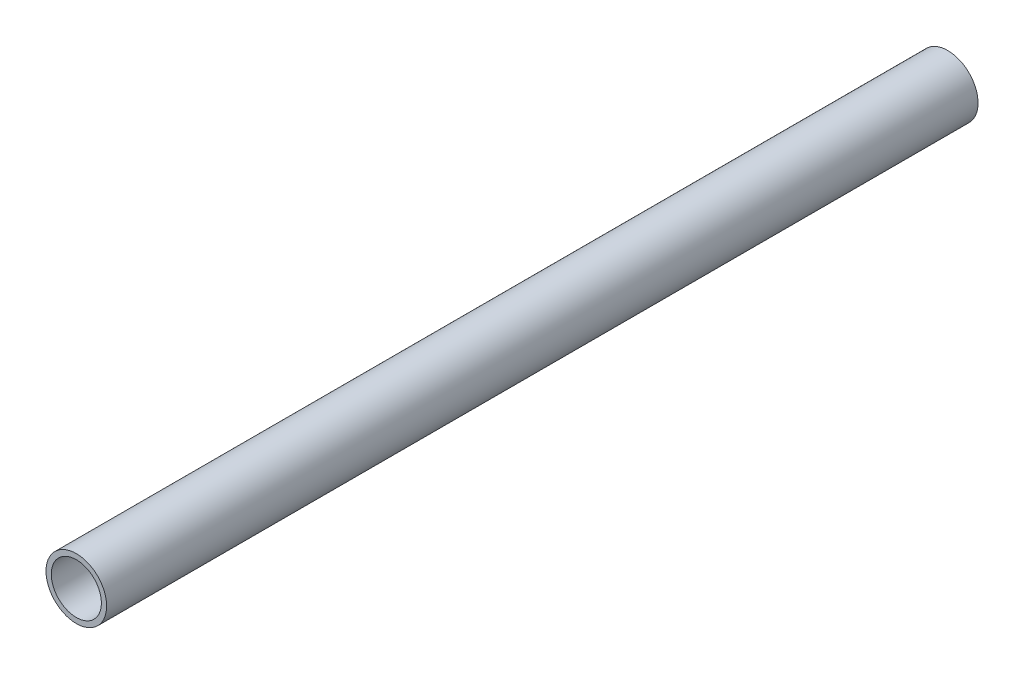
ISO-10303-21;
HEADER;
FILE_DESCRIPTION(('STEP AP214'),'2;1');
FILE_NAME('part.step','',(''),(''),'','','');
FILE_SCHEMA(('AUTOMOTIVE_DESIGN { 1 0 10303 214 1 1 1 1 }'));
ENDSEC;
DATA;
#1=APPLICATION_CONTEXT('core data for automotive mechanical design processes');
#2=APPLICATION_PROTOCOL_DEFINITION('international standard','automotive_design',2000,#1);
#3=PRODUCT_CONTEXT('',#1,'mechanical');
#4=PRODUCT('Part','Part','',(#3));
#5=PRODUCT_RELATED_PRODUCT_CATEGORY('part','',(#4));
#6=PRODUCT_DEFINITION_FORMATION('','',#4);
#7=PRODUCT_DEFINITION_CONTEXT('part definition',#1,'design');
#8=PRODUCT_DEFINITION('design','',#6,#7);
#9=PRODUCT_DEFINITION_SHAPE('','',#8);
#10=(LENGTH_UNIT() NAMED_UNIT(*) SI_UNIT(.MILLI.,.METRE.));
#11=(NAMED_UNIT(*) PLANE_ANGLE_UNIT() SI_UNIT($,.RADIAN.));
#12=(NAMED_UNIT(*) SI_UNIT($,.STERADIAN.) SOLID_ANGLE_UNIT());
#13=UNCERTAINTY_MEASURE_WITH_UNIT(LENGTH_MEASURE(1.E-05),#10,'distance_accuracy_value','');
#14=(GEOMETRIC_REPRESENTATION_CONTEXT(3) GLOBAL_UNCERTAINTY_ASSIGNED_CONTEXT((#13)) GLOBAL_UNIT_ASSIGNED_CONTEXT((#10,
#11,#12)) REPRESENTATION_CONTEXT('',''));
#15=CARTESIAN_POINT('',(0.,0.,0.));
#16=DIRECTION('',(0.,0.,1.));
#17=DIRECTION('',(1.,0.,0.));
#18=AXIS2_PLACEMENT_3D('',#15,#16,#17);
#19=CARTESIAN_POINT('',(0.,0.,304.8));
#20=DIRECTION('',(0.,0.,1.));
#21=DIRECTION('',(1.,0.,0.));
#22=AXIS2_PLACEMENT_3D('',#19,#20,#21);
#23=PLANE('',#22);
#24=CARTESIAN_POINT('',(0.,0.,304.8));
#25=DIRECTION('',(0.,0.,1.));
#26=DIRECTION('',(1.,0.,0.));
#27=AXIS2_PLACEMENT_3D('',#24,#25,#26);
#28=CIRCLE('',#27,21.209);
#29=CARTESIAN_POINT('',(-21.209,0.,304.8));
#30=VERTEX_POINT('',#29);
#31=EDGE_CURVE('E10',#30,#30,#28,.T.);
#32=ORIENTED_EDGE('',*,*,#31,.T.);
#33=EDGE_LOOP('',(#32));
#34=FACE_BOUND('',#33,.T.);
#35=CARTESIAN_POINT('',(0.,0.,304.8));
#36=DIRECTION('',(0.,0.,1.));
#37=DIRECTION('',(1.,0.,0.));
#38=AXIS2_PLACEMENT_3D('',#35,#36,#37);
#39=CIRCLE('',#38,17.526);
#40=CARTESIAN_POINT('',(-17.526,0.,304.8));
#41=VERTEX_POINT('',#40);
#42=EDGE_CURVE('E38',#41,#41,#39,.T.);
#43=ORIENTED_EDGE('',*,*,#42,.F.);
#44=EDGE_LOOP('',(#43));
#45=FACE_BOUND('',#44,.T.);
#46=ADVANCED_FACE('F27',(#34,#45),#23,.T.);
#47=CARTESIAN_POINT('',(0.,0.,-304.8));
#48=DIRECTION('',(0.,0.,1.));
#49=DIRECTION('',(1.,0.,0.));
#50=AXIS2_PLACEMENT_3D('',#47,#48,#49);
#51=PLANE('',#50);
#52=CARTESIAN_POINT('',(0.,0.,-304.8));
#53=DIRECTION('',(0.,0.,1.));
#54=DIRECTION('',(1.,0.,0.));
#55=AXIS2_PLACEMENT_3D('',#52,#53,#54);
#56=CIRCLE('',#55,21.209);
#57=CARTESIAN_POINT('',(-21.209,0.,-304.8));
#58=VERTEX_POINT('',#57);
#59=EDGE_CURVE('E34',#58,#58,#56,.T.);
#60=ORIENTED_EDGE('',*,*,#59,.F.);
#61=EDGE_LOOP('',(#60));
#62=FACE_BOUND('',#61,.T.);
#63=CARTESIAN_POINT('',(0.,0.,-304.8));
#64=DIRECTION('',(0.,0.,1.));
#65=DIRECTION('',(1.,0.,0.));
#66=AXIS2_PLACEMENT_3D('',#63,#64,#65);
#67=CIRCLE('',#66,17.526);
#68=CARTESIAN_POINT('',(-17.526,0.,-304.8));
#69=VERTEX_POINT('',#68);
#70=EDGE_CURVE('E42',#69,#69,#67,.T.);
#71=ORIENTED_EDGE('',*,*,#70,.T.);
#72=EDGE_LOOP('',(#71));
#73=FACE_BOUND('',#72,.T.);
#74=ADVANCED_FACE('F48',(#62,#73),#51,.F.);
#75=CARTESIAN_POINT('',(0.,0.,304.8));
#76=DIRECTION('',(0.,0.,-1.));
#77=DIRECTION('',(-1.,0.,0.));
#78=AXIS2_PLACEMENT_3D('',#75,#76,#77);
#79=CYLINDRICAL_SURFACE('',#78,21.209);
#80=CARTESIAN_POINT('',(-21.209,0.,304.8));
#81=CARTESIAN_POINT('',(-21.209,0.,298.45));
#82=CARTESIAN_POINT('',(-21.209,0.,292.1));
#83=CARTESIAN_POINT('',(-21.209,0.,279.4));
#84=CARTESIAN_POINT('',(-21.209,0.,273.05));
#85=CARTESIAN_POINT('',(-21.209,0.,260.35));
#86=CARTESIAN_POINT('',(-21.209,0.,254.));
#87=CARTESIAN_POINT('',(-21.209,0.,241.3));
#88=CARTESIAN_POINT('',(-21.209,0.,234.95));
#89=CARTESIAN_POINT('',(-21.209,0.,222.25));
#90=CARTESIAN_POINT('',(-21.209,0.,215.9));
#91=CARTESIAN_POINT('',(-21.209,0.,203.2));
#92=CARTESIAN_POINT('',(-21.209,0.,196.85));
#93=CARTESIAN_POINT('',(-21.209,0.,184.15));
#94=CARTESIAN_POINT('',(-21.209,0.,177.8));
#95=CARTESIAN_POINT('',(-21.209,0.,165.1));
#96=CARTESIAN_POINT('',(-21.209,0.,158.75));
#97=CARTESIAN_POINT('',(-21.209,0.,146.05));
#98=CARTESIAN_POINT('',(-21.209,0.,139.7));
#99=CARTESIAN_POINT('',(-21.209,0.,127.));
#100=CARTESIAN_POINT('',(-21.209,0.,120.65));
#101=CARTESIAN_POINT('',(-21.209,0.,107.95));
#102=CARTESIAN_POINT('',(-21.209,0.,101.6));
#103=CARTESIAN_POINT('',(-21.209,0.,88.9));
#104=CARTESIAN_POINT('',(-21.209,0.,82.55));
#105=CARTESIAN_POINT('',(-21.209,0.,69.85));
#106=CARTESIAN_POINT('',(-21.209,0.,63.5));
#107=CARTESIAN_POINT('',(-21.209,0.,50.8));
#108=CARTESIAN_POINT('',(-21.209,0.,44.45));
#109=CARTESIAN_POINT('',(-21.209,0.,31.75));
#110=CARTESIAN_POINT('',(-21.209,0.,25.4));
#111=CARTESIAN_POINT('',(-21.209,0.,12.7));
#112=CARTESIAN_POINT('',(-21.209,0.,6.35));
#113=CARTESIAN_POINT('',(-21.209,0.,-6.35));
#114=CARTESIAN_POINT('',(-21.209,0.,-12.7));
#115=CARTESIAN_POINT('',(-21.209,0.,-25.4));
#116=CARTESIAN_POINT('',(-21.209,0.,-31.75));
#117=CARTESIAN_POINT('',(-21.209,0.,-44.45));
#118=CARTESIAN_POINT('',(-21.209,0.,-50.8));
#119=CARTESIAN_POINT('',(-21.209,0.,-63.5));
#120=CARTESIAN_POINT('',(-21.209,0.,-69.85));
#121=CARTESIAN_POINT('',(-21.209,0.,-82.55));
#122=CARTESIAN_POINT('',(-21.209,0.,-88.9));
#123=CARTESIAN_POINT('',(-21.209,0.,-101.6));
#124=CARTESIAN_POINT('',(-21.209,0.,-107.95));
#125=CARTESIAN_POINT('',(-21.209,0.,-120.65));
#126=CARTESIAN_POINT('',(-21.209,0.,-127.));
#127=CARTESIAN_POINT('',(-21.209,0.,-139.7));
#128=CARTESIAN_POINT('',(-21.209,0.,-146.05));
#129=CARTESIAN_POINT('',(-21.209,0.,-158.75));
#130=CARTESIAN_POINT('',(-21.209,0.,-165.1));
#131=CARTESIAN_POINT('',(-21.209,0.,-177.8));
#132=CARTESIAN_POINT('',(-21.209,0.,-184.15));
#133=CARTESIAN_POINT('',(-21.209,0.,-196.85));
#134=CARTESIAN_POINT('',(-21.209,0.,-203.2));
#135=CARTESIAN_POINT('',(-21.209,0.,-215.9));
#136=CARTESIAN_POINT('',(-21.209,0.,-222.25));
#137=CARTESIAN_POINT('',(-21.209,0.,-234.95));
#138=CARTESIAN_POINT('',(-21.209,0.,-241.3));
#139=CARTESIAN_POINT('',(-21.209,0.,-254.));
#140=CARTESIAN_POINT('',(-21.209,0.,-260.35));
#141=CARTESIAN_POINT('',(-21.209,0.,-273.05));
#142=CARTESIAN_POINT('',(-21.209,0.,-279.4));
#143=CARTESIAN_POINT('',(-21.209,0.,-292.1));
#144=CARTESIAN_POINT('',(-21.209,0.,-298.45));
#145=CARTESIAN_POINT('',(-21.209,0.,-304.8));
#146=B_SPLINE_CURVE_WITH_KNOTS('',3,(#80,#81,#82,#83,#84,#85,#86,#87,#88,#89,#90,#91,#92,#93,
#94,#95,#96,#97,#98,#99,#100,#101,#102,#103,#104,#105,#106,#107,#108,#109,#110,#111,#112,#113,
#114,#115,#116,#117,#118,#119,#120,#121,#122,#123,#124,#125,#126,#127,#128,#129,#130,#131,#132,
#133,#134,#135,#136,#137,#138,#139,#140,#141,#142,#143,#144,#145),.UNSPECIFIED.,.F.,.F.,(4,2,2,
2,2,2,2,2,2,2,2,2,2,2,2,2,2,2,2,2,2,2,2,2,2,2,2,2,2,2,2,2,4),(0.,19.05,38.1,57.15,76.2,
95.2500000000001,114.3,133.35,152.4,171.45,190.5,209.55,228.6,247.65,266.7,285.75,304.8,323.85,
342.9,361.95,381.,400.05,419.1,438.15,457.2,476.25,495.3,514.35,533.4,552.45,571.5,590.55,
609.6),.UNSPECIFIED.);
#147=EDGE_CURVE('BSEAM29',#30,#58,#146,.T.);
#148=ORIENTED_EDGE('',*,*,#31,.F.);
#149=ORIENTED_EDGE('',*,*,#59,.T.);
#150=ORIENTED_EDGE('',*,*,#147,.T.);
#151=ORIENTED_EDGE('',*,*,#147,.F.);
#152=EDGE_LOOP('',(#148,#150,#149,#151));
#153=FACE_BOUND('',#152,.T.);
#154=ADVANCED_FACE('F29',(#153),#79,.T.);
#155=CARTESIAN_POINT('',(0.,0.,304.8));
#156=DIRECTION('',(0.,0.,-1.));
#157=DIRECTION('',(-1.,0.,0.));
#158=AXIS2_PLACEMENT_3D('',#155,#156,#157);
#159=CYLINDRICAL_SURFACE('',#158,17.526);
#160=CARTESIAN_POINT('',(-17.526,0.,304.8));
#161=CARTESIAN_POINT('',(-17.526,0.,298.45));
#162=CARTESIAN_POINT('',(-17.526,0.,292.1));
#163=CARTESIAN_POINT('',(-17.526,0.,279.4));
#164=CARTESIAN_POINT('',(-17.526,0.,273.05));
#165=CARTESIAN_POINT('',(-17.526,0.,260.35));
#166=CARTESIAN_POINT('',(-17.526,0.,254.));
#167=CARTESIAN_POINT('',(-17.526,0.,241.3));
#168=CARTESIAN_POINT('',(-17.526,0.,234.95));
#169=CARTESIAN_POINT('',(-17.526,0.,222.25));
#170=CARTESIAN_POINT('',(-17.526,0.,215.9));
#171=CARTESIAN_POINT('',(-17.526,0.,203.2));
#172=CARTESIAN_POINT('',(-17.526,0.,196.85));
#173=CARTESIAN_POINT('',(-17.526,0.,184.15));
#174=CARTESIAN_POINT('',(-17.526,0.,177.8));
#175=CARTESIAN_POINT('',(-17.526,0.,165.1));
#176=CARTESIAN_POINT('',(-17.526,0.,158.75));
#177=CARTESIAN_POINT('',(-17.526,0.,146.05));
#178=CARTESIAN_POINT('',(-17.526,0.,139.7));
#179=CARTESIAN_POINT('',(-17.526,0.,127.));
#180=CARTESIAN_POINT('',(-17.526,0.,120.65));
#181=CARTESIAN_POINT('',(-17.526,0.,107.95));
#182=CARTESIAN_POINT('',(-17.526,0.,101.6));
#183=CARTESIAN_POINT('',(-17.526,0.,88.9));
#184=CARTESIAN_POINT('',(-17.526,0.,82.55));
#185=CARTESIAN_POINT('',(-17.526,0.,69.85));
#186=CARTESIAN_POINT('',(-17.526,0.,63.5));
#187=CARTESIAN_POINT('',(-17.526,0.,50.8));
#188=CARTESIAN_POINT('',(-17.526,0.,44.45));
#189=CARTESIAN_POINT('',(-17.526,0.,31.75));
#190=CARTESIAN_POINT('',(-17.526,0.,25.4));
#191=CARTESIAN_POINT('',(-17.526,0.,12.7));
#192=CARTESIAN_POINT('',(-17.526,0.,6.34999999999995));
#193=CARTESIAN_POINT('',(-17.526,0.,-6.35000000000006));
#194=CARTESIAN_POINT('',(-17.526,0.,-12.7000000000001));
#195=CARTESIAN_POINT('',(-17.526,0.,-25.4000000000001));
#196=CARTESIAN_POINT('',(-17.526,0.,-31.7500000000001));
#197=CARTESIAN_POINT('',(-17.526,0.,-44.4500000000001));
#198=CARTESIAN_POINT('',(-17.526,0.,-50.8000000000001));
#199=CARTESIAN_POINT('',(-17.526,0.,-63.5000000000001));
#200=CARTESIAN_POINT('',(-17.526,0.,-69.8500000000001));
#201=CARTESIAN_POINT('',(-17.526,0.,-82.5500000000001));
#202=CARTESIAN_POINT('',(-17.526,0.,-88.9000000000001));
#203=CARTESIAN_POINT('',(-17.526,0.,-101.6));
#204=CARTESIAN_POINT('',(-17.526,0.,-107.95));
#205=CARTESIAN_POINT('',(-17.526,0.,-120.65));
#206=CARTESIAN_POINT('',(-17.526,0.,-127.));
#207=CARTESIAN_POINT('',(-17.526,0.,-139.7));
#208=CARTESIAN_POINT('',(-17.526,0.,-146.05));
#209=CARTESIAN_POINT('',(-17.526,0.,-158.75));
#210=CARTESIAN_POINT('',(-17.526,0.,-165.1));
#211=CARTESIAN_POINT('',(-17.526,0.,-177.8));
#212=CARTESIAN_POINT('',(-17.526,0.,-184.15));
#213=CARTESIAN_POINT('',(-17.526,0.,-196.85));
#214=CARTESIAN_POINT('',(-17.526,0.,-203.2));
#215=CARTESIAN_POINT('',(-17.526,0.,-215.9));
#216=CARTESIAN_POINT('',(-17.526,0.,-222.25));
#217=CARTESIAN_POINT('',(-17.526,0.,-234.95));
#218=CARTESIAN_POINT('',(-17.526,0.,-241.3));
#219=CARTESIAN_POINT('',(-17.526,0.,-254.));
#220=CARTESIAN_POINT('',(-17.526,0.,-260.35));
#221=CARTESIAN_POINT('',(-17.526,0.,-273.05));
#222=CARTESIAN_POINT('',(-17.526,0.,-279.4));
#223=CARTESIAN_POINT('',(-17.526,0.,-292.1));
#224=CARTESIAN_POINT('',(-17.526,0.,-298.45));
#225=CARTESIAN_POINT('',(-17.526,0.,-304.8));
#226=B_SPLINE_CURVE_WITH_KNOTS('',3,(#160,#161,#162,#163,#164,#165,#166,#167,#168,#169,#170,
#171,#172,#173,#174,#175,#176,#177,#178,#179,#180,#181,#182,#183,#184,#185,#186,#187,#188,#189,
#190,#191,#192,#193,#194,#195,#196,#197,#198,#199,#200,#201,#202,#203,#204,#205,#206,#207,#208,
#209,#210,#211,#212,#213,#214,#215,#216,#217,#218,#219,#220,#221,#222,#223,#224,#225),
.UNSPECIFIED.,.F.,.F.,(4,2,2,2,2,2,2,2,2,2,2,2,2,2,2,2,2,2,2,2,2,2,2,2,2,2,2,2,2,2,2,2,4),(0.,
19.05,38.1,57.15,76.2,95.25,114.3,133.35,152.4,171.45,190.5,209.55,228.6,247.65,266.7,285.75,
304.8,323.85,342.9,361.95,381.,400.05,419.1,438.15,457.2,476.25,495.3,514.35,533.4,552.45,571.5,
590.55,609.6),.UNSPECIFIED.);
#227=EDGE_CURVE('BSEAM50',#41,#69,#226,.T.);
#228=ORIENTED_EDGE('',*,*,#42,.T.);
#229=ORIENTED_EDGE('',*,*,#70,.F.);
#230=ORIENTED_EDGE('',*,*,#227,.T.);
#231=ORIENTED_EDGE('',*,*,#227,.F.);
#232=EDGE_LOOP('',(#228,#230,#229,#231));
#233=FACE_BOUND('',#232,.T.);
#234=ADVANCED_FACE('F50',(#233),#159,.F.);
#235=CLOSED_SHELL('',(#46,#74,#154,#234));
#236=MANIFOLD_SOLID_BREP('B2',#235);
#237=ADVANCED_BREP_SHAPE_REPRESENTATION('',(#18,#236),#14);
#238=SHAPE_DEFINITION_REPRESENTATION(#9,#237);
ENDSEC;
END-ISO-10303-21;
